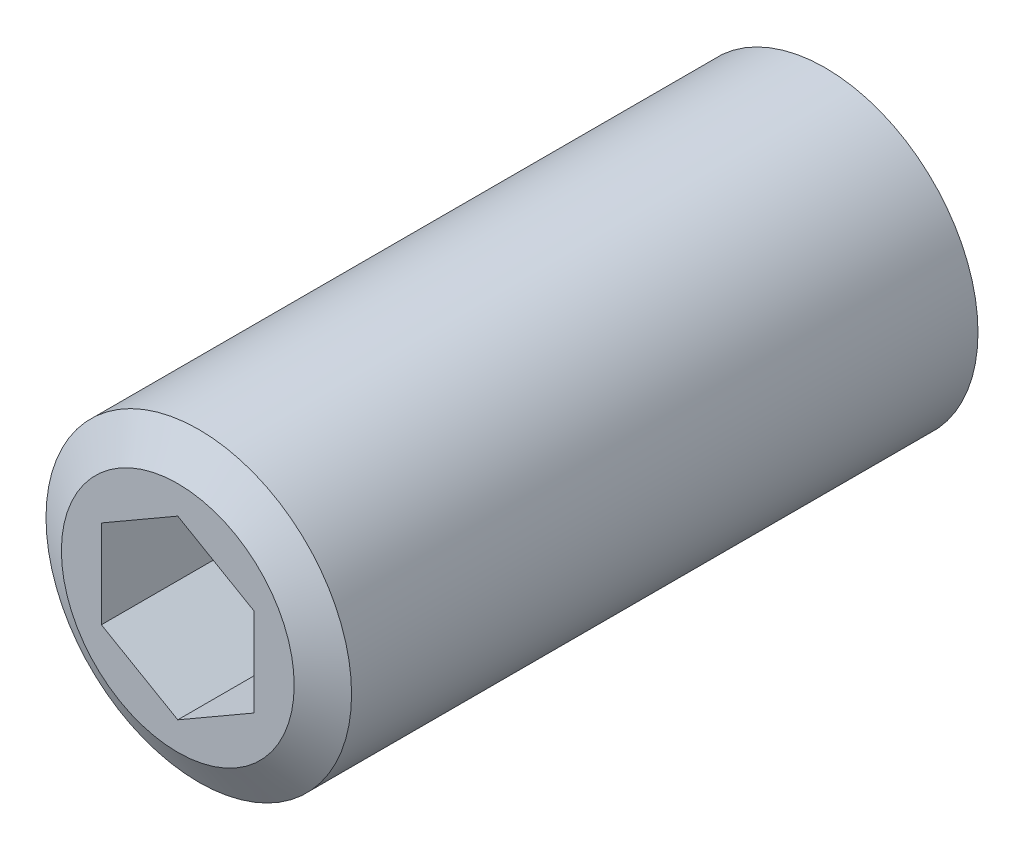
ISO-10303-21;
HEADER;
FILE_DESCRIPTION(('STEP AP214'),'2;1');
FILE_NAME('part.step','',(''),(''),'','','');
FILE_SCHEMA(('AUTOMOTIVE_DESIGN { 1 0 10303 214 1 1 1 1 }'));
ENDSEC;
DATA;
#1=APPLICATION_CONTEXT('core data for automotive mechanical design processes');
#2=APPLICATION_PROTOCOL_DEFINITION('international standard','automotive_design',2000,#1);
#3=PRODUCT_CONTEXT('',#1,'mechanical');
#4=PRODUCT('Part','Part','',(#3));
#5=PRODUCT_RELATED_PRODUCT_CATEGORY('part','',(#4));
#6=PRODUCT_DEFINITION_FORMATION('','',#4);
#7=PRODUCT_DEFINITION_CONTEXT('part definition',#1,'design');
#8=PRODUCT_DEFINITION('design','',#6,#7);
#9=PRODUCT_DEFINITION_SHAPE('','',#8);
#10=(LENGTH_UNIT() NAMED_UNIT(*) SI_UNIT(.MILLI.,.METRE.));
#11=(NAMED_UNIT(*) PLANE_ANGLE_UNIT() SI_UNIT($,.RADIAN.));
#12=(NAMED_UNIT(*) SI_UNIT($,.STERADIAN.) SOLID_ANGLE_UNIT());
#13=UNCERTAINTY_MEASURE_WITH_UNIT(LENGTH_MEASURE(1.E-05),#10,'distance_accuracy_value','');
#14=(GEOMETRIC_REPRESENTATION_CONTEXT(3) GLOBAL_UNCERTAINTY_ASSIGNED_CONTEXT((#13)) GLOBAL_UNIT_ASSIGNED_CONTEXT((#10,
#11,#12)) REPRESENTATION_CONTEXT('',''));
#15=CARTESIAN_POINT('',(0.,0.,0.));
#16=DIRECTION('',(0.,0.,1.));
#17=DIRECTION('',(1.,0.,0.));
#18=AXIS2_PLACEMENT_3D('',#15,#16,#17);
#19=CARTESIAN_POINT('',(0.,0.,0.));
#20=DIRECTION('',(0.,0.,-1.));
#21=DIRECTION('',(-1.,0.,0.));
#22=AXIS2_PLACEMENT_3D('',#19,#20,#21);
#23=PLANE('',#22);
#24=CARTESIAN_POINT('',(0.,0.,0.));
#25=DIRECTION('',(0.,0.,-1.));
#26=DIRECTION('',(-1.,0.,0.));
#27=AXIS2_PLACEMENT_3D('',#24,#25,#26);
#28=CIRCLE('',#27,4.25);
#29=CARTESIAN_POINT('',(-4.25,0.,0.));
#30=VERTEX_POINT('',#29);
#31=EDGE_CURVE('E9',#30,#30,#28,.T.);
#32=ORIENTED_EDGE('',*,*,#31,.T.);
#33=EDGE_LOOP('',(#32));
#34=FACE_BOUND('',#33,.T.);
#35=ADVANCED_FACE('F14',(#34),#23,.T.);
#36=CARTESIAN_POINT('',(0.,0.,-2.));
#37=DIRECTION('',(0.,0.,-1.));
#38=DIRECTION('',(-1.,0.,0.));
#39=AXIS2_PLACEMENT_3D('',#36,#37,#38);
#40=CYLINDRICAL_SURFACE('',#39,4.25);
#41=CARTESIAN_POINT('',(0.,0.,1.5));
#42=DIRECTION('',(0.,0.,-1.));
#43=DIRECTION('',(-1.,0.,0.));
#44=AXIS2_PLACEMENT_3D('',#41,#42,#43);
#45=CIRCLE('',#44,4.25);
#46=CARTESIAN_POINT('',(-4.25,0.,1.5));
#47=VERTEX_POINT('',#46);
#48=EDGE_CURVE('E21',#47,#47,#45,.T.);
#49=ORIENTED_EDGE('',*,*,#48,.T.);
#50=EDGE_LOOP('',(#49));
#51=FACE_BOUND('',#50,.T.);
#52=ORIENTED_EDGE('',*,*,#31,.F.);
#53=EDGE_LOOP('',(#52));
#54=FACE_BOUND('',#53,.T.);
#55=ADVANCED_FACE('F134',(#51,#54),#40,.T.);
#56=CARTESIAN_POINT('',(0.,4.25,1.5));
#57=DIRECTION('',(0.,0.,-1.));
#58=DIRECTION('',(-1.,0.,0.));
#59=AXIS2_PLACEMENT_3D('',#56,#57,#58);
#60=PLANE('',#59);
#61=CARTESIAN_POINT('',(0.,0.,1.5));
#62=DIRECTION('',(0.,0.,-1.));
#63=DIRECTION('',(-1.,0.,0.));
#64=AXIS2_PLACEMENT_3D('',#61,#62,#63);
#65=CIRCLE('',#64,6.094744);
#66=CARTESIAN_POINT('',(-6.094744,0.,1.5));
#67=VERTEX_POINT('',#66);
#68=EDGE_CURVE('E129',#67,#67,#65,.T.);
#69=ORIENTED_EDGE('',*,*,#68,.T.);
#70=EDGE_LOOP('',(#69));
#71=FACE_BOUND('',#70,.T.);
#72=ORIENTED_EDGE('',*,*,#48,.F.);
#73=EDGE_LOOP('',(#72));
#74=FACE_BOUND('',#73,.T.);
#75=ADVANCED_FACE('F137',(#71,#74),#60,.T.);
#76=CARTESIAN_POINT('',(0.,0.,1.5));
#77=DIRECTION('',(0.,0.,1.));
#78=DIRECTION('',(1.,0.,0.));
#79=AXIS2_PLACEMENT_3D('',#76,#77,#78);
#80=CONICAL_SURFACE('',#79,6.094744,1.04719757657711);
#81=CARTESIAN_POINT('',(0.,0.,2.6));
#82=DIRECTION('',(0.,0.,-1.));
#83=DIRECTION('',(-1.,0.,0.));
#84=AXIS2_PLACEMENT_3D('',#81,#82,#83);
#85=CIRCLE('',#84,8.);
#86=CARTESIAN_POINT('',(-8.,0.,2.6));
#87=VERTEX_POINT('',#86);
#88=EDGE_CURVE('E126',#87,#87,#85,.T.);
#89=ORIENTED_EDGE('',*,*,#88,.T.);
#90=EDGE_LOOP('',(#89));
#91=FACE_BOUND('',#90,.T.);
#92=ORIENTED_EDGE('',*,*,#68,.F.);
#93=EDGE_LOOP('',(#92));
#94=FACE_BOUND('',#93,.T.);
#95=ADVANCED_FACE('F139',(#91,#94),#80,.T.);
#96=CARTESIAN_POINT('',(0.,0.,-2.));
#97=DIRECTION('',(0.,0.,-1.));
#98=DIRECTION('',(-1.,0.,0.));
#99=AXIS2_PLACEMENT_3D('',#96,#97,#98);
#100=CYLINDRICAL_SURFACE('',#99,8.);
#101=CARTESIAN_POINT('',(0.,0.,35.4));
#102=DIRECTION('',(0.,0.,-1.));
#103=DIRECTION('',(-1.,0.,0.));
#104=AXIS2_PLACEMENT_3D('',#101,#102,#103);
#105=CIRCLE('',#104,8.);
#106=CARTESIAN_POINT('',(-8.,0.,35.4));
#107=VERTEX_POINT('',#106);
#108=EDGE_CURVE('E123',#107,#107,#105,.T.);
#109=ORIENTED_EDGE('',*,*,#108,.T.);
#110=EDGE_LOOP('',(#109));
#111=FACE_BOUND('',#110,.T.);
#112=ORIENTED_EDGE('',*,*,#88,.F.);
#113=EDGE_LOOP('',(#112));
#114=FACE_BOUND('',#113,.T.);
#115=ADVANCED_FACE('F148',(#111,#114),#100,.T.);
#116=CARTESIAN_POINT('',(0.,0.,35.4));
#117=DIRECTION('',(0.,0.,-1.));
#118=DIRECTION('',(-1.,0.,0.));
#119=AXIS2_PLACEMENT_3D('',#116,#117,#118);
#120=CONICAL_SURFACE('',#119,8.,1.0471975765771);
#121=CARTESIAN_POINT('',(0.,0.,36.5));
#122=DIRECTION('',(0.,0.,-1.));
#123=DIRECTION('',(-1.,0.,0.));
#124=AXIS2_PLACEMENT_3D('',#121,#122,#123);
#125=CIRCLE('',#124,6.094744);
#126=CARTESIAN_POINT('',(-6.094744,0.,36.5));
#127=VERTEX_POINT('',#126);
#128=EDGE_CURVE('E115',#127,#127,#125,.T.);
#129=ORIENTED_EDGE('',*,*,#128,.T.);
#130=EDGE_LOOP('',(#129));
#131=FACE_BOUND('',#130,.T.);
#132=ORIENTED_EDGE('',*,*,#108,.F.);
#133=EDGE_LOOP('',(#132));
#134=FACE_BOUND('',#133,.T.);
#135=ADVANCED_FACE('F187',(#131,#134),#120,.T.);
#136=CARTESIAN_POINT('',(0.,0.,36.5));
#137=DIRECTION('',(0.,0.,1.));
#138=DIRECTION('',(1.,0.,0.));
#139=AXIS2_PLACEMENT_3D('',#136,#137,#138);
#140=PLANE('',#139);
#141=DIRECTION('',(-0.866025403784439,0.5,0.));
#142=VECTOR('',#141,1.);
#143=CARTESIAN_POINT('',(4.,2.30940107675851,36.5));
#144=LINE('',#143,#142);
#145=CARTESIAN_POINT('',(4.,2.30940107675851,36.5));
#146=VERTEX_POINT('',#145);
#147=CARTESIAN_POINT('',(0.,4.61880215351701,36.5));
#148=VERTEX_POINT('',#147);
#149=EDGE_CURVE('E28',#146,#148,#144,.T.);
#150=ORIENTED_EDGE('',*,*,#149,.F.);
#151=DIRECTION('',(0.,1.,0.));
#152=VECTOR('',#151,1.);
#153=CARTESIAN_POINT('',(4.,-2.30940107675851,36.5));
#154=LINE('',#153,#152);
#155=CARTESIAN_POINT('',(4.,-2.30940107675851,36.5));
#156=VERTEX_POINT('',#155);
#157=EDGE_CURVE('E111',#156,#146,#154,.T.);
#158=ORIENTED_EDGE('',*,*,#157,.F.);
#159=DIRECTION('',(0.866025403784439,0.5,0.));
#160=VECTOR('',#159,1.);
#161=CARTESIAN_POINT('',(0.,-4.61880215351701,36.5));
#162=LINE('',#161,#160);
#163=CARTESIAN_POINT('',(0.,-4.61880215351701,36.5));
#164=VERTEX_POINT('',#163);
#165=EDGE_CURVE('E109',#164,#156,#162,.T.);
#166=ORIENTED_EDGE('',*,*,#165,.F.);
#167=DIRECTION('',(0.866025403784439,-0.5,0.));
#168=VECTOR('',#167,1.);
#169=CARTESIAN_POINT('',(-4.,-2.30940107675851,36.5));
#170=LINE('',#169,#168);
#171=CARTESIAN_POINT('',(-4.,-2.30940107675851,36.5));
#172=VERTEX_POINT('',#171);
#173=EDGE_CURVE('E76',#172,#164,#170,.T.);
#174=ORIENTED_EDGE('',*,*,#173,.F.);
#175=DIRECTION('',(0.,-1.,0.));
#176=VECTOR('',#175,1.);
#177=CARTESIAN_POINT('',(-4.,2.30940107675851,36.5));
#178=LINE('',#177,#176);
#179=CARTESIAN_POINT('',(-4.,2.30940107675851,36.5));
#180=VERTEX_POINT('',#179);
#181=EDGE_CURVE('E105',#180,#172,#178,.T.);
#182=ORIENTED_EDGE('',*,*,#181,.F.);
#183=DIRECTION('',(-0.866025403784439,-0.5,0.));
#184=VECTOR('',#183,1.);
#185=CARTESIAN_POINT('',(0.,4.61880215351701,36.5));
#186=LINE('',#185,#184);
#187=EDGE_CURVE('E102',#148,#180,#186,.T.);
#188=ORIENTED_EDGE('',*,*,#187,.F.);
#189=EDGE_LOOP('',(#150,#158,#166,#174,#182,#188));
#190=FACE_BOUND('',#189,.T.);
#191=ORIENTED_EDGE('',*,*,#128,.F.);
#192=EDGE_LOOP('',(#191));
#193=FACE_BOUND('',#192,.T.);
#194=ADVANCED_FACE('F195',(#190,#193),#140,.T.);
#195=CARTESIAN_POINT('',(4.,2.30940107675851,30.5));
#196=DIRECTION('',(0.5,0.866025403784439,0.));
#197=DIRECTION('',(-0.866025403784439,0.5,0.));
#198=AXIS2_PLACEMENT_3D('',#195,#196,#197);
#199=PLANE('',#198);
#200=ORIENTED_EDGE('',*,*,#149,.T.);
#201=DIRECTION('',(0.,0.,1.));
#202=VECTOR('',#201,1.);
#203=CARTESIAN_POINT('',(0.,4.61880215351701,30.5));
#204=LINE('',#203,#202);
#205=CARTESIAN_POINT('',(0.,4.61880215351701,30.5));
#206=VERTEX_POINT('',#205);
#207=EDGE_CURVE('E58',#206,#148,#204,.T.);
#208=ORIENTED_EDGE('',*,*,#207,.F.);
#209=DIRECTION('',(-0.866025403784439,0.5,0.));
#210=VECTOR('',#209,1.);
#211=CARTESIAN_POINT('',(4.,2.30940107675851,30.5));
#212=LINE('',#211,#210);
#213=CARTESIAN_POINT('',(4.,2.30940107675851,30.5));
#214=VERTEX_POINT('',#213);
#215=EDGE_CURVE('E113',#214,#206,#212,.T.);
#216=ORIENTED_EDGE('',*,*,#215,.F.);
#217=DIRECTION('',(0.,0.,1.));
#218=VECTOR('',#217,1.);
#219=CARTESIAN_POINT('',(4.,2.30940107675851,30.5));
#220=LINE('',#219,#218);
#221=EDGE_CURVE('E36',#214,#146,#220,.T.);
#222=ORIENTED_EDGE('',*,*,#221,.T.);
#223=EDGE_LOOP('',(#200,#208,#216,#222));
#224=FACE_BOUND('',#223,.T.);
#225=ADVANCED_FACE('F204',(#224),#199,.F.);
#226=CARTESIAN_POINT('',(4.,-2.30940107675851,30.5));
#227=DIRECTION('',(1.,0.,0.));
#228=DIRECTION('',(0.,0.,-1.));
#229=AXIS2_PLACEMENT_3D('',#226,#227,#228);
#230=PLANE('',#229);
#231=ORIENTED_EDGE('',*,*,#157,.T.);
#232=ORIENTED_EDGE('',*,*,#221,.F.);
#233=DIRECTION('',(0.,1.,0.));
#234=VECTOR('',#233,1.);
#235=CARTESIAN_POINT('',(4.,-2.30940107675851,30.5));
#236=LINE('',#235,#234);
#237=CARTESIAN_POINT('',(4.,-2.30940107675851,30.5));
#238=VERTEX_POINT('',#237);
#239=EDGE_CURVE('E88',#238,#214,#236,.T.);
#240=ORIENTED_EDGE('',*,*,#239,.F.);
#241=DIRECTION('',(0.,0.,1.));
#242=VECTOR('',#241,1.);
#243=CARTESIAN_POINT('',(4.,-2.30940107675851,30.5));
#244=LINE('',#243,#242);
#245=EDGE_CURVE('E80',#238,#156,#244,.T.);
#246=ORIENTED_EDGE('',*,*,#245,.T.);
#247=EDGE_LOOP('',(#231,#232,#240,#246));
#248=FACE_BOUND('',#247,.T.);
#249=ADVANCED_FACE('F213',(#248),#230,.F.);
#250=CARTESIAN_POINT('',(0.,-4.61880215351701,30.5));
#251=DIRECTION('',(0.5,-0.866025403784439,0.));
#252=DIRECTION('',(0.866025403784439,0.5,0.));
#253=AXIS2_PLACEMENT_3D('',#250,#251,#252);
#254=PLANE('',#253);
#255=ORIENTED_EDGE('',*,*,#165,.T.);
#256=ORIENTED_EDGE('',*,*,#245,.F.);
#257=DIRECTION('',(0.866025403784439,0.5,0.));
#258=VECTOR('',#257,1.);
#259=CARTESIAN_POINT('',(0.,-4.61880215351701,30.5));
#260=LINE('',#259,#258);
#261=CARTESIAN_POINT('',(0.,-4.61880215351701,30.5));
#262=VERTEX_POINT('',#261);
#263=EDGE_CURVE('E84',#262,#238,#260,.T.);
#264=ORIENTED_EDGE('',*,*,#263,.F.);
#265=DIRECTION('',(0.,0.,1.));
#266=VECTOR('',#265,1.);
#267=CARTESIAN_POINT('',(0.,-4.61880215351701,30.5));
#268=LINE('',#267,#266);
#269=EDGE_CURVE('E69',#262,#164,#268,.T.);
#270=ORIENTED_EDGE('',*,*,#269,.T.);
#271=EDGE_LOOP('',(#255,#256,#264,#270));
#272=FACE_BOUND('',#271,.T.);
#273=ADVANCED_FACE('F85',(#272),#254,.F.);
#274=CARTESIAN_POINT('',(-4.,-2.30940107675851,30.5));
#275=DIRECTION('',(-0.5,-0.866025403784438,0.));
#276=DIRECTION('',(0.866025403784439,-0.5,0.));
#277=AXIS2_PLACEMENT_3D('',#274,#275,#276);
#278=PLANE('',#277);
#279=ORIENTED_EDGE('',*,*,#173,.T.);
#280=ORIENTED_EDGE('',*,*,#269,.F.);
#281=DIRECTION('',(0.866025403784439,-0.5,0.));
#282=VECTOR('',#281,1.);
#283=CARTESIAN_POINT('',(-4.,-2.30940107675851,30.5));
#284=LINE('',#283,#282);
#285=CARTESIAN_POINT('',(-4.,-2.30940107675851,30.5));
#286=VERTEX_POINT('',#285);
#287=EDGE_CURVE('E73',#286,#262,#284,.T.);
#288=ORIENTED_EDGE('',*,*,#287,.F.);
#289=DIRECTION('',(0.,0.,1.));
#290=VECTOR('',#289,1.);
#291=CARTESIAN_POINT('',(-4.,-2.30940107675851,30.5));
#292=LINE('',#291,#290);
#293=EDGE_CURVE('E81',#286,#172,#292,.T.);
#294=ORIENTED_EDGE('',*,*,#293,.T.);
#295=EDGE_LOOP('',(#279,#280,#288,#294));
#296=FACE_BOUND('',#295,.T.);
#297=ADVANCED_FACE('F71',(#296),#278,.F.);
#298=CARTESIAN_POINT('',(-4.,2.30940107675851,30.5));
#299=DIRECTION('',(-1.,0.,0.));
#300=DIRECTION('',(0.,0.,1.));
#301=AXIS2_PLACEMENT_3D('',#298,#299,#300);
#302=PLANE('',#301);
#303=ORIENTED_EDGE('',*,*,#181,.T.);
#304=ORIENTED_EDGE('',*,*,#293,.F.);
#305=DIRECTION('',(0.,-1.,0.));
#306=VECTOR('',#305,1.);
#307=CARTESIAN_POINT('',(-4.,2.30940107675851,30.5));
#308=LINE('',#307,#306);
#309=CARTESIAN_POINT('',(-4.,2.30940107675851,30.5));
#310=VERTEX_POINT('',#309);
#311=EDGE_CURVE('E94',#310,#286,#308,.T.);
#312=ORIENTED_EDGE('',*,*,#311,.F.);
#313=DIRECTION('',(0.,0.,1.));
#314=VECTOR('',#313,1.);
#315=CARTESIAN_POINT('',(-4.,2.30940107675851,30.5));
#316=LINE('',#315,#314);
#317=EDGE_CURVE('E118',#310,#180,#316,.T.);
#318=ORIENTED_EDGE('',*,*,#317,.T.);
#319=EDGE_LOOP('',(#303,#304,#312,#318));
#320=FACE_BOUND('',#319,.T.);
#321=ADVANCED_FACE('F235',(#320),#302,.F.);
#322=CARTESIAN_POINT('',(0.,4.61880215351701,30.5));
#323=DIRECTION('',(-0.5,0.866025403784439,0.));
#324=DIRECTION('',(-0.866025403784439,-0.5,0.));
#325=AXIS2_PLACEMENT_3D('',#322,#323,#324);
#326=PLANE('',#325);
#327=ORIENTED_EDGE('',*,*,#187,.T.);
#328=ORIENTED_EDGE('',*,*,#317,.F.);
#329=DIRECTION('',(-0.866025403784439,-0.5,0.));
#330=VECTOR('',#329,1.);
#331=CARTESIAN_POINT('',(0.,4.61880215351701,30.5));
#332=LINE('',#331,#330);
#333=EDGE_CURVE('E96',#206,#310,#332,.T.);
#334=ORIENTED_EDGE('',*,*,#333,.F.);
#335=ORIENTED_EDGE('',*,*,#207,.T.);
#336=EDGE_LOOP('',(#327,#328,#334,#335));
#337=FACE_BOUND('',#336,.T.);
#338=ADVANCED_FACE('F243',(#337),#326,.F.);
#339=CARTESIAN_POINT('',(0.,4.61880215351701,30.5));
#340=DIRECTION('',(0.,0.,1.));
#341=DIRECTION('',(1.,0.,0.));
#342=AXIS2_PLACEMENT_3D('',#339,#340,#341);
#343=PLANE('',#342);
#344=ORIENTED_EDGE('',*,*,#215,.T.);
#345=ORIENTED_EDGE('',*,*,#333,.T.);
#346=ORIENTED_EDGE('',*,*,#311,.T.);
#347=ORIENTED_EDGE('',*,*,#287,.T.);
#348=ORIENTED_EDGE('',*,*,#263,.T.);
#349=ORIENTED_EDGE('',*,*,#239,.T.);
#350=EDGE_LOOP('',(#344,#345,#346,#347,#348,#349));
#351=FACE_BOUND('',#350,.T.);
#352=ADVANCED_FACE('F91',(#351),#343,.T.);
#353=CLOSED_SHELL('',(#35,#55,#75,#95,#115,#135,#194,#225,#249,#273,#297,#321,#338,#352));
#354=MANIFOLD_SOLID_BREP('B1',#353);
#355=ADVANCED_BREP_SHAPE_REPRESENTATION('',(#18,#354),#14);
#356=SHAPE_DEFINITION_REPRESENTATION(#9,#355);
ENDSEC;
END-ISO-10303-21;
